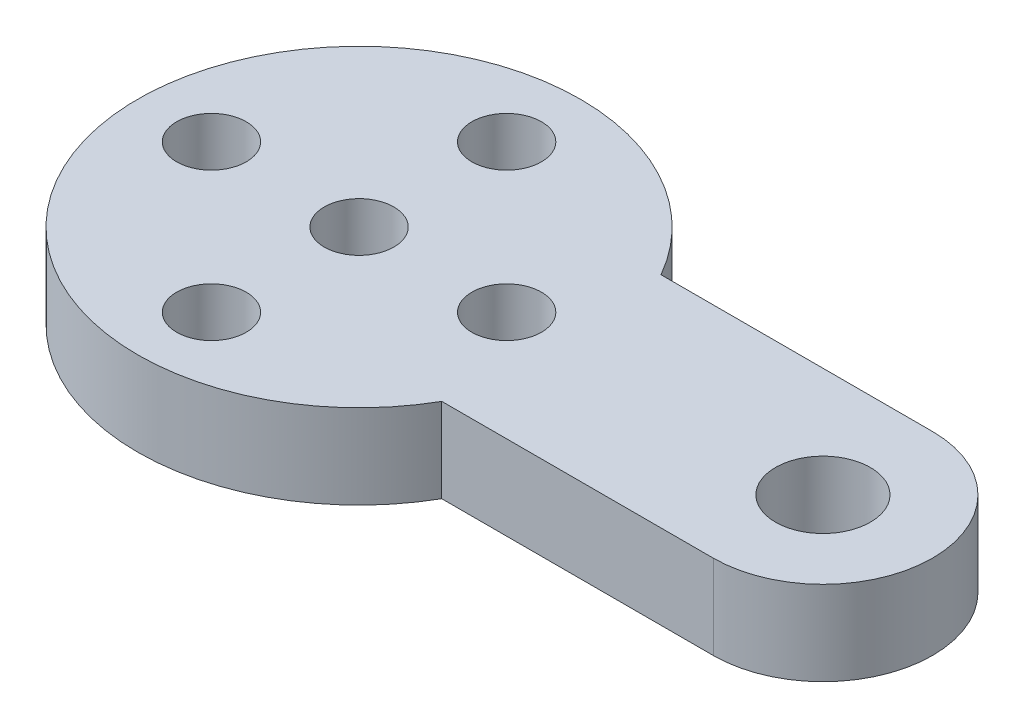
ISO-10303-21;
HEADER;
FILE_DESCRIPTION(('STEP AP214'),'2;1');
FILE_NAME('part.step','',(''),(''),'','','');
FILE_SCHEMA(('AUTOMOTIVE_DESIGN { 1 0 10303 214 1 1 1 1 }'));
ENDSEC;
DATA;
#1=APPLICATION_CONTEXT('core data for automotive mechanical design processes');
#2=APPLICATION_PROTOCOL_DEFINITION('international standard','automotive_design',2000,#1);
#3=PRODUCT_CONTEXT('',#1,'mechanical');
#4=PRODUCT('Part','Part','',(#3));
#5=PRODUCT_RELATED_PRODUCT_CATEGORY('part','',(#4));
#6=PRODUCT_DEFINITION_FORMATION('','',#4);
#7=PRODUCT_DEFINITION_CONTEXT('part definition',#1,'design');
#8=PRODUCT_DEFINITION('design','',#6,#7);
#9=PRODUCT_DEFINITION_SHAPE('','',#8);
#10=(LENGTH_UNIT() NAMED_UNIT(*) SI_UNIT(.MILLI.,.METRE.));
#11=(NAMED_UNIT(*) PLANE_ANGLE_UNIT() SI_UNIT($,.RADIAN.));
#12=(NAMED_UNIT(*) SI_UNIT($,.STERADIAN.) SOLID_ANGLE_UNIT());
#13=UNCERTAINTY_MEASURE_WITH_UNIT(LENGTH_MEASURE(1.E-05),#10,'distance_accuracy_value','');
#14=(GEOMETRIC_REPRESENTATION_CONTEXT(3) GLOBAL_UNCERTAINTY_ASSIGNED_CONTEXT((#13)) GLOBAL_UNIT_ASSIGNED_CONTEXT((#10,
#11,#12)) REPRESENTATION_CONTEXT('',''));
#15=CARTESIAN_POINT('',(0.,0.,0.));
#16=DIRECTION('',(0.,0.,1.));
#17=DIRECTION('',(1.,0.,0.));
#18=AXIS2_PLACEMENT_3D('',#15,#16,#17);
#19=CARTESIAN_POINT('',(0.,35.5,-41.));
#20=DIRECTION('',(0.,1.,0.));
#21=DIRECTION('',(0.,0.,1.));
#22=AXIS2_PLACEMENT_3D('',#19,#20,#21);
#23=PLANE('',#22);
#24=CARTESIAN_POINT('',(22.,35.5,-41.));
#25=DIRECTION('',(0.,1.,0.));
#26=DIRECTION('',(0.,0.,1.));
#27=AXIS2_PLACEMENT_3D('',#24,#25,#26);
#28=CIRCLE('',#27,2.25);
#29=CARTESIAN_POINT('',(22.,35.5,-38.75));
#30=VERTEX_POINT('',#29);
#31=EDGE_CURVE('E115',#30,#30,#28,.T.);
#32=ORIENTED_EDGE('',*,*,#31,.F.);
#33=EDGE_LOOP('',(#32));
#34=FACE_BOUND('',#33,.T.);
#35=CARTESIAN_POINT('',(0.,35.5,-34.));
#36=DIRECTION('',(0.,1.,0.));
#37=DIRECTION('',(0.,0.,1.));
#38=AXIS2_PLACEMENT_3D('',#35,#36,#37);
#39=CIRCLE('',#38,1.65);
#40=CARTESIAN_POINT('',(0.,35.5,-32.35));
#41=VERTEX_POINT('',#40);
#42=EDGE_CURVE('E108',#41,#41,#39,.T.);
#43=ORIENTED_EDGE('',*,*,#42,.F.);
#44=EDGE_LOOP('',(#43));
#45=FACE_BOUND('',#44,.T.);
#46=CARTESIAN_POINT('',(0.,35.5,-48.));
#47=DIRECTION('',(0.,1.,0.));
#48=DIRECTION('',(0.,0.,1.));
#49=AXIS2_PLACEMENT_3D('',#46,#47,#48);
#50=CIRCLE('',#49,1.65);
#51=CARTESIAN_POINT('',(0.,35.5,-46.35));
#52=VERTEX_POINT('',#51);
#53=EDGE_CURVE('E106',#52,#52,#50,.T.);
#54=ORIENTED_EDGE('',*,*,#53,.F.);
#55=EDGE_LOOP('',(#54));
#56=FACE_BOUND('',#55,.T.);
#57=CARTESIAN_POINT('',(7.,35.5,-41.));
#58=DIRECTION('',(0.,1.,0.));
#59=DIRECTION('',(0.,0.,1.));
#60=AXIS2_PLACEMENT_3D('',#57,#58,#59);
#61=CIRCLE('',#60,1.65);
#62=CARTESIAN_POINT('',(7.,35.5,-39.35));
#63=VERTEX_POINT('',#62);
#64=EDGE_CURVE('E105',#63,#63,#61,.T.);
#65=ORIENTED_EDGE('',*,*,#64,.F.);
#66=EDGE_LOOP('',(#65));
#67=FACE_BOUND('',#66,.T.);
#68=CARTESIAN_POINT('',(-7.,35.5,-41.));
#69=DIRECTION('',(0.,1.,0.));
#70=DIRECTION('',(0.,0.,1.));
#71=AXIS2_PLACEMENT_3D('',#68,#69,#70);
#72=CIRCLE('',#71,1.65);
#73=CARTESIAN_POINT('',(-7.,35.5,-39.35));
#74=VERTEX_POINT('',#73);
#75=EDGE_CURVE('E98',#74,#74,#72,.T.);
#76=ORIENTED_EDGE('',*,*,#75,.F.);
#77=EDGE_LOOP('',(#76));
#78=FACE_BOUND('',#77,.T.);
#79=CARTESIAN_POINT('',(0.,35.5,-41.));
#80=DIRECTION('',(0.,1.,0.));
#81=DIRECTION('',(0.,0.,1.));
#82=AXIS2_PLACEMENT_3D('',#79,#80,#81);
#83=CIRCLE('',#82,1.65);
#84=CARTESIAN_POINT('',(0.,35.5,-39.35));
#85=VERTEX_POINT('',#84);
#86=EDGE_CURVE('E77',#85,#85,#83,.T.);
#87=ORIENTED_EDGE('',*,*,#86,.F.);
#88=EDGE_LOOP('',(#87));
#89=FACE_BOUND('',#88,.T.);
#90=DIRECTION('',(1.,0.,0.));
#91=VECTOR('',#90,1.);
#92=CARTESIAN_POINT('',(11.,35.5,-35.8));
#93=LINE('',#92,#91);
#94=CARTESIAN_POINT('',(9.12195154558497,35.5,-35.8));
#95=VERTEX_POINT('',#94);
#96=CARTESIAN_POINT('',(22.,35.5,-35.8));
#97=VERTEX_POINT('',#96);
#98=EDGE_CURVE('E64',#95,#97,#93,.T.);
#99=ORIENTED_EDGE('',*,*,#98,.T.);
#100=CARTESIAN_POINT('',(22.,35.5,-41.));
#101=DIRECTION('',(0.,-1.,0.));
#102=DIRECTION('',(0.,0.,-1.));
#103=AXIS2_PLACEMENT_3D('',#100,#101,#102);
#104=CIRCLE('',#103,5.2);
#105=CARTESIAN_POINT('',(22.,35.5,-46.2));
#106=VERTEX_POINT('',#105);
#107=EDGE_CURVE('E75',#106,#97,#104,.T.);
#108=ORIENTED_EDGE('',*,*,#107,.F.);
#109=DIRECTION('',(-1.,0.,0.));
#110=VECTOR('',#109,1.);
#111=CARTESIAN_POINT('',(11.,35.5,-46.2));
#112=LINE('',#111,#110);
#113=CARTESIAN_POINT('',(9.12195154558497,35.5,-46.2));
#114=VERTEX_POINT('',#113);
#115=EDGE_CURVE('E87',#106,#114,#112,.T.);
#116=ORIENTED_EDGE('',*,*,#115,.T.);
#117=CARTESIAN_POINT('',(0.,35.5,-41.));
#118=DIRECTION('',(0.,-1.,0.));
#119=DIRECTION('',(0.,0.,-1.));
#120=AXIS2_PLACEMENT_3D('',#117,#118,#119);
#121=CIRCLE('',#120,10.5);
#122=EDGE_CURVE('E91',#95,#114,#121,.T.);
#123=ORIENTED_EDGE('',*,*,#122,.F.);
#124=EDGE_LOOP('',(#99,#108,#116,#123));
#125=FACE_BOUND('',#124,.T.);
#126=ADVANCED_FACE('F16',(#34,#45,#56,#67,#78,#89,#125),#23,.T.);
#127=CARTESIAN_POINT('',(0.,31.5,-41.));
#128=DIRECTION('',(0.,-1.,0.));
#129=DIRECTION('',(0.,0.,-1.));
#130=AXIS2_PLACEMENT_3D('',#127,#128,#129);
#131=PLANE('',#130);
#132=CARTESIAN_POINT('',(22.,31.5,-41.));
#133=DIRECTION('',(0.,-1.,0.));
#134=DIRECTION('',(0.,0.,-1.));
#135=AXIS2_PLACEMENT_3D('',#132,#133,#134);
#136=CIRCLE('',#135,2.25);
#137=CARTESIAN_POINT('',(22.,31.5,-43.25));
#138=VERTEX_POINT('',#137);
#139=EDGE_CURVE('E20',#138,#138,#136,.T.);
#140=ORIENTED_EDGE('',*,*,#139,.F.);
#141=EDGE_LOOP('',(#140));
#142=FACE_BOUND('',#141,.T.);
#143=CARTESIAN_POINT('',(0.,31.5,-34.));
#144=DIRECTION('',(0.,-1.,0.));
#145=DIRECTION('',(0.,0.,-1.));
#146=AXIS2_PLACEMENT_3D('',#143,#144,#145);
#147=CIRCLE('',#146,1.65);
#148=CARTESIAN_POINT('',(0.,31.5,-35.65));
#149=VERTEX_POINT('',#148);
#150=EDGE_CURVE('E109',#149,#149,#147,.T.);
#151=ORIENTED_EDGE('',*,*,#150,.F.);
#152=EDGE_LOOP('',(#151));
#153=FACE_BOUND('',#152,.T.);
#154=CARTESIAN_POINT('',(0.,31.5,-48.));
#155=DIRECTION('',(0.,-1.,0.));
#156=DIRECTION('',(0.,0.,-1.));
#157=AXIS2_PLACEMENT_3D('',#154,#155,#156);
#158=CIRCLE('',#157,1.65);
#159=CARTESIAN_POINT('',(0.,31.5,-49.65));
#160=VERTEX_POINT('',#159);
#161=EDGE_CURVE('E110',#160,#160,#158,.T.);
#162=ORIENTED_EDGE('',*,*,#161,.F.);
#163=EDGE_LOOP('',(#162));
#164=FACE_BOUND('',#163,.T.);
#165=CARTESIAN_POINT('',(7.,31.5,-41.));
#166=DIRECTION('',(0.,-1.,0.));
#167=DIRECTION('',(0.,0.,-1.));
#168=AXIS2_PLACEMENT_3D('',#165,#166,#167);
#169=CIRCLE('',#168,1.65);
#170=CARTESIAN_POINT('',(7.,31.5,-42.65));
#171=VERTEX_POINT('',#170);
#172=EDGE_CURVE('E103',#171,#171,#169,.T.);
#173=ORIENTED_EDGE('',*,*,#172,.F.);
#174=EDGE_LOOP('',(#173));
#175=FACE_BOUND('',#174,.T.);
#176=CARTESIAN_POINT('',(-7.,31.5,-41.));
#177=DIRECTION('',(0.,-1.,0.));
#178=DIRECTION('',(0.,0.,-1.));
#179=AXIS2_PLACEMENT_3D('',#176,#177,#178);
#180=CIRCLE('',#179,1.65);
#181=CARTESIAN_POINT('',(-7.,31.5,-42.65));
#182=VERTEX_POINT('',#181);
#183=EDGE_CURVE('E97',#182,#182,#180,.T.);
#184=ORIENTED_EDGE('',*,*,#183,.F.);
#185=EDGE_LOOP('',(#184));
#186=FACE_BOUND('',#185,.T.);
#187=CARTESIAN_POINT('',(0.,31.5,-41.));
#188=DIRECTION('',(0.,-1.,0.));
#189=DIRECTION('',(0.,0.,-1.));
#190=AXIS2_PLACEMENT_3D('',#187,#188,#189);
#191=CIRCLE('',#190,1.65);
#192=CARTESIAN_POINT('',(0.,31.5,-42.65));
#193=VERTEX_POINT('',#192);
#194=EDGE_CURVE('E85',#193,#193,#191,.T.);
#195=ORIENTED_EDGE('',*,*,#194,.F.);
#196=EDGE_LOOP('',(#195));
#197=FACE_BOUND('',#196,.T.);
#198=DIRECTION('',(1.,0.,0.));
#199=VECTOR('',#198,1.);
#200=CARTESIAN_POINT('',(11.,31.5,-46.2));
#201=LINE('',#200,#199);
#202=CARTESIAN_POINT('',(9.12195154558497,31.5,-46.2));
#203=VERTEX_POINT('',#202);
#204=CARTESIAN_POINT('',(22.,31.5,-46.2));
#205=VERTEX_POINT('',#204);
#206=EDGE_CURVE('E76',#203,#205,#201,.T.);
#207=ORIENTED_EDGE('',*,*,#206,.T.);
#208=CARTESIAN_POINT('',(22.,31.5,-41.));
#209=DIRECTION('',(0.,1.,0.));
#210=DIRECTION('',(0.,0.,1.));
#211=AXIS2_PLACEMENT_3D('',#208,#209,#210);
#212=CIRCLE('',#211,5.2);
#213=CARTESIAN_POINT('',(22.,31.5,-35.8));
#214=VERTEX_POINT('',#213);
#215=EDGE_CURVE('E66',#214,#205,#212,.T.);
#216=ORIENTED_EDGE('',*,*,#215,.F.);
#217=DIRECTION('',(-1.,0.,0.));
#218=VECTOR('',#217,1.);
#219=CARTESIAN_POINT('',(11.,31.5,-35.8));
#220=LINE('',#219,#218);
#221=CARTESIAN_POINT('',(9.12195154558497,31.5,-35.8));
#222=VERTEX_POINT('',#221);
#223=EDGE_CURVE('E54',#214,#222,#220,.T.);
#224=ORIENTED_EDGE('',*,*,#223,.T.);
#225=CARTESIAN_POINT('',(0.,31.5,-41.));
#226=DIRECTION('',(0.,1.,0.));
#227=DIRECTION('',(0.,0.,1.));
#228=AXIS2_PLACEMENT_3D('',#225,#226,#227);
#229=CIRCLE('',#228,10.5);
#230=EDGE_CURVE('E38',#203,#222,#229,.T.);
#231=ORIENTED_EDGE('',*,*,#230,.F.);
#232=EDGE_LOOP('',(#207,#216,#224,#231));
#233=FACE_BOUND('',#232,.T.);
#234=ADVANCED_FACE('F72',(#142,#153,#164,#175,#186,#197,#233),#131,.T.);
#235=CARTESIAN_POINT('',(0.,31.5,-41.));
#236=DIRECTION('',(0.,1.,0.));
#237=DIRECTION('',(0.,0.,1.));
#238=AXIS2_PLACEMENT_3D('',#235,#236,#237);
#239=CYLINDRICAL_SURFACE('',#238,10.5);
#240=DIRECTION('',(0.,1.,0.));
#241=VECTOR('',#240,1.);
#242=CARTESIAN_POINT('',(9.12195154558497,31.5,-35.8));
#243=LINE('',#242,#241);
#244=EDGE_CURVE('E10',#95,#222,#243,.F.);
#245=ORIENTED_EDGE('',*,*,#244,.F.);
#246=ORIENTED_EDGE('',*,*,#122,.T.);
#247=DIRECTION('',(0.,1.,0.));
#248=VECTOR('',#247,1.);
#249=CARTESIAN_POINT('',(9.12195154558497,31.5,-46.2));
#250=LINE('',#249,#248);
#251=EDGE_CURVE('E25',#203,#114,#250,.T.);
#252=ORIENTED_EDGE('',*,*,#251,.F.);
#253=ORIENTED_EDGE('',*,*,#230,.T.);
#254=EDGE_LOOP('',(#245,#246,#252,#253));
#255=FACE_BOUND('',#254,.T.);
#256=ADVANCED_FACE('F18',(#255),#239,.T.);
#257=CARTESIAN_POINT('',(11.,33.5,-35.8));
#258=DIRECTION('',(0.,0.,1.));
#259=DIRECTION('',(1.,0.,0.));
#260=AXIS2_PLACEMENT_3D('',#257,#258,#259);
#261=PLANE('',#260);
#262=ORIENTED_EDGE('',*,*,#98,.F.);
#263=ORIENTED_EDGE('',*,*,#244,.T.);
#264=ORIENTED_EDGE('',*,*,#223,.F.);
#265=DIRECTION('',(0.,-1.,0.));
#266=VECTOR('',#265,1.);
#267=CARTESIAN_POINT('',(22.,33.5,-35.8));
#268=LINE('',#267,#266);
#269=EDGE_CURVE('E56',#97,#214,#268,.T.);
#270=ORIENTED_EDGE('',*,*,#269,.F.);
#271=EDGE_LOOP('',(#262,#263,#264,#270));
#272=FACE_BOUND('',#271,.T.);
#273=ADVANCED_FACE('F59',(#272),#261,.T.);
#274=CARTESIAN_POINT('',(11.,33.5,-46.2));
#275=DIRECTION('',(0.,0.,-1.));
#276=DIRECTION('',(-1.,0.,0.));
#277=AXIS2_PLACEMENT_3D('',#274,#275,#276);
#278=PLANE('',#277);
#279=ORIENTED_EDGE('',*,*,#206,.F.);
#280=ORIENTED_EDGE('',*,*,#251,.T.);
#281=ORIENTED_EDGE('',*,*,#115,.F.);
#282=DIRECTION('',(0.,1.,0.));
#283=VECTOR('',#282,1.);
#284=CARTESIAN_POINT('',(22.,33.5,-46.2));
#285=LINE('',#284,#283);
#286=EDGE_CURVE('E71',#205,#106,#285,.T.);
#287=ORIENTED_EDGE('',*,*,#286,.F.);
#288=EDGE_LOOP('',(#279,#280,#281,#287));
#289=FACE_BOUND('',#288,.T.);
#290=ADVANCED_FACE('F136',(#289),#278,.T.);
#291=CARTESIAN_POINT('',(22.,31.5,-41.));
#292=DIRECTION('',(0.,1.,0.));
#293=DIRECTION('',(0.,0.,1.));
#294=AXIS2_PLACEMENT_3D('',#291,#292,#293);
#295=CYLINDRICAL_SURFACE('',#294,5.2);
#296=ORIENTED_EDGE('',*,*,#215,.T.);
#297=ORIENTED_EDGE('',*,*,#286,.T.);
#298=ORIENTED_EDGE('',*,*,#107,.T.);
#299=ORIENTED_EDGE('',*,*,#269,.T.);
#300=EDGE_LOOP('',(#296,#297,#298,#299));
#301=FACE_BOUND('',#300,.T.);
#302=ADVANCED_FACE('F70',(#301),#295,.T.);
#303=CARTESIAN_POINT('',(0.,31.35,-41.));
#304=DIRECTION('',(0.,1.,0.));
#305=DIRECTION('',(0.,0.,1.));
#306=AXIS2_PLACEMENT_3D('',#303,#304,#305);
#307=CYLINDRICAL_SURFACE('',#306,1.65);
#308=ORIENTED_EDGE('',*,*,#86,.T.);
#309=EDGE_LOOP('',(#308));
#310=FACE_BOUND('',#309,.T.);
#311=ORIENTED_EDGE('',*,*,#194,.T.);
#312=EDGE_LOOP('',(#311));
#313=FACE_BOUND('',#312,.T.);
#314=ADVANCED_FACE('F150',(#310,#313),#307,.F.);
#315=CARTESIAN_POINT('',(-7.,31.35,-41.));
#316=DIRECTION('',(0.,1.,0.));
#317=DIRECTION('',(0.,0.,1.));
#318=AXIS2_PLACEMENT_3D('',#315,#316,#317);
#319=CYLINDRICAL_SURFACE('',#318,1.65);
#320=ORIENTED_EDGE('',*,*,#75,.T.);
#321=EDGE_LOOP('',(#320));
#322=FACE_BOUND('',#321,.T.);
#323=ORIENTED_EDGE('',*,*,#183,.T.);
#324=EDGE_LOOP('',(#323));
#325=FACE_BOUND('',#324,.T.);
#326=ADVANCED_FACE('F127',(#322,#325),#319,.F.);
#327=CARTESIAN_POINT('',(7.,31.35,-41.));
#328=DIRECTION('',(0.,1.,0.));
#329=DIRECTION('',(0.,0.,1.));
#330=AXIS2_PLACEMENT_3D('',#327,#328,#329);
#331=CYLINDRICAL_SURFACE('',#330,1.65);
#332=ORIENTED_EDGE('',*,*,#64,.T.);
#333=EDGE_LOOP('',(#332));
#334=FACE_BOUND('',#333,.T.);
#335=ORIENTED_EDGE('',*,*,#172,.T.);
#336=EDGE_LOOP('',(#335));
#337=FACE_BOUND('',#336,.T.);
#338=ADVANCED_FACE('F174',(#334,#337),#331,.F.);
#339=CARTESIAN_POINT('',(0.,31.35,-48.));
#340=DIRECTION('',(0.,1.,0.));
#341=DIRECTION('',(0.,0.,1.));
#342=AXIS2_PLACEMENT_3D('',#339,#340,#341);
#343=CYLINDRICAL_SURFACE('',#342,1.65);
#344=ORIENTED_EDGE('',*,*,#53,.T.);
#345=EDGE_LOOP('',(#344));
#346=FACE_BOUND('',#345,.T.);
#347=ORIENTED_EDGE('',*,*,#161,.T.);
#348=EDGE_LOOP('',(#347));
#349=FACE_BOUND('',#348,.T.);
#350=ADVANCED_FACE('F179',(#346,#349),#343,.F.);
#351=CARTESIAN_POINT('',(0.,31.35,-34.));
#352=DIRECTION('',(0.,1.,0.));
#353=DIRECTION('',(0.,0.,1.));
#354=AXIS2_PLACEMENT_3D('',#351,#352,#353);
#355=CYLINDRICAL_SURFACE('',#354,1.65);
#356=ORIENTED_EDGE('',*,*,#42,.T.);
#357=EDGE_LOOP('',(#356));
#358=FACE_BOUND('',#357,.T.);
#359=ORIENTED_EDGE('',*,*,#150,.T.);
#360=EDGE_LOOP('',(#359));
#361=FACE_BOUND('',#360,.T.);
#362=ADVANCED_FACE('F181',(#358,#361),#355,.F.);
#363=CARTESIAN_POINT('',(22.,31.35,-41.));
#364=DIRECTION('',(0.,1.,0.));
#365=DIRECTION('',(0.,0.,1.));
#366=AXIS2_PLACEMENT_3D('',#363,#364,#365);
#367=CYLINDRICAL_SURFACE('',#366,2.25);
#368=ORIENTED_EDGE('',*,*,#31,.T.);
#369=EDGE_LOOP('',(#368));
#370=FACE_BOUND('',#369,.T.);
#371=ORIENTED_EDGE('',*,*,#139,.T.);
#372=EDGE_LOOP('',(#371));
#373=FACE_BOUND('',#372,.T.);
#374=ADVANCED_FACE('F186',(#370,#373),#367,.F.);
#375=CLOSED_SHELL('',(#126,#234,#256,#273,#290,#302,#314,#326,#338,#350,#362,#374));
#376=MANIFOLD_SOLID_BREP('B1',#375);
#377=ADVANCED_BREP_SHAPE_REPRESENTATION('',(#18,#376),#14);
#378=SHAPE_DEFINITION_REPRESENTATION(#9,#377);
ENDSEC;
END-ISO-10303-21;
